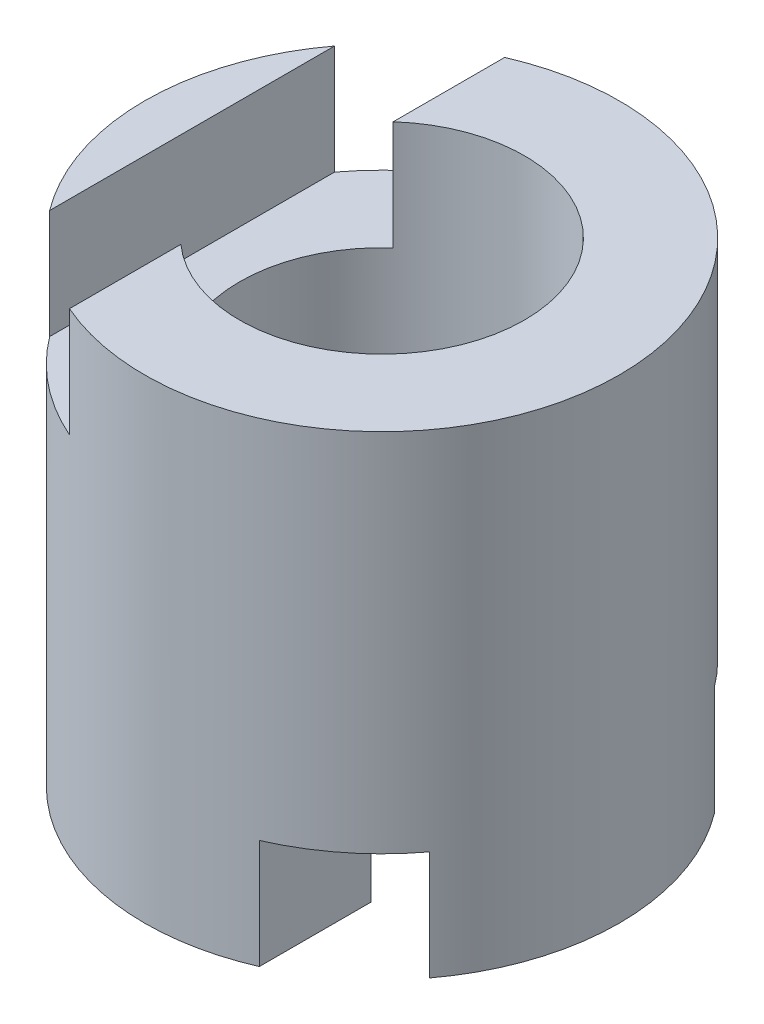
ISO-10303-21;
HEADER;
FILE_DESCRIPTION(('STEP AP214'),'2;1');
FILE_NAME('part.step','',(''),(''),'','','');
FILE_SCHEMA(('AUTOMOTIVE_DESIGN { 1 0 10303 214 1 1 1 1 }'));
ENDSEC;
DATA;
#1=APPLICATION_CONTEXT('core data for automotive mechanical design processes');
#2=APPLICATION_PROTOCOL_DEFINITION('international standard','automotive_design',2000,#1);
#3=PRODUCT_CONTEXT('',#1,'mechanical');
#4=PRODUCT('Part','Part','',(#3));
#5=PRODUCT_RELATED_PRODUCT_CATEGORY('part','',(#4));
#6=PRODUCT_DEFINITION_FORMATION('','',#4);
#7=PRODUCT_DEFINITION_CONTEXT('part definition',#1,'design');
#8=PRODUCT_DEFINITION('design','',#6,#7);
#9=PRODUCT_DEFINITION_SHAPE('','',#8);
#10=(LENGTH_UNIT() NAMED_UNIT(*) SI_UNIT(.MILLI.,.METRE.));
#11=(NAMED_UNIT(*) PLANE_ANGLE_UNIT() SI_UNIT($,.RADIAN.));
#12=(NAMED_UNIT(*) SI_UNIT($,.STERADIAN.) SOLID_ANGLE_UNIT());
#13=UNCERTAINTY_MEASURE_WITH_UNIT(LENGTH_MEASURE(1.E-05),#10,'distance_accuracy_value','');
#14=(GEOMETRIC_REPRESENTATION_CONTEXT(3) GLOBAL_UNCERTAINTY_ASSIGNED_CONTEXT((#13)) GLOBAL_UNIT_ASSIGNED_CONTEXT((#10,
#11,#12)) REPRESENTATION_CONTEXT('',''));
#15=CARTESIAN_POINT('',(0.,0.,0.));
#16=DIRECTION('',(0.,0.,1.));
#17=DIRECTION('',(1.,0.,0.));
#18=AXIS2_PLACEMENT_3D('',#15,#16,#17);
#19=CARTESIAN_POINT('',(0.,-100.,0.));
#20=DIRECTION('',(0.,1.,0.));
#21=DIRECTION('',(0.,0.,1.));
#22=AXIS2_PLACEMENT_3D('',#19,#20,#21);
#23=PLANE('',#22);
#24=CARTESIAN_POINT('',(0.,-100.,0.));
#25=DIRECTION('',(0.,1.,0.));
#26=DIRECTION('',(0.,0.,1.));
#27=AXIS2_PLACEMENT_3D('',#24,#25,#26);
#28=CIRCLE('',#27,50.);
#29=CARTESIAN_POINT('',(20.,-100.,-45.8257569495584));
#30=VERTEX_POINT('',#29);
#31=CARTESIAN_POINT('',(20.,-100.,45.8257569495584));
#32=VERTEX_POINT('',#31);
#33=EDGE_CURVE('E203',#30,#32,#28,.T.);
#34=ORIENTED_EDGE('',*,*,#33,.F.);
#35=DIRECTION('',(0.,0.,1.));
#36=VECTOR('',#35,1.);
#37=CARTESIAN_POINT('',(20.,-100.,-50.));
#38=LINE('',#37,#36);
#39=CARTESIAN_POINT('',(20.,-100.,-22.3606797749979));
#40=VERTEX_POINT('',#39);
#41=EDGE_CURVE('E143',#30,#40,#38,.T.);
#42=ORIENTED_EDGE('',*,*,#41,.T.);
#43=CARTESIAN_POINT('',(0.,-100.,0.));
#44=DIRECTION('',(0.,1.,0.));
#45=DIRECTION('',(0.,0.,1.));
#46=AXIS2_PLACEMENT_3D('',#43,#44,#45);
#47=CIRCLE('',#46,30.);
#48=CARTESIAN_POINT('',(20.,-100.,22.3606797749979));
#49=VERTEX_POINT('',#48);
#50=EDGE_CURVE('E195',#40,#49,#47,.T.);
#51=ORIENTED_EDGE('',*,*,#50,.T.);
#52=EDGE_CURVE('E169',#49,#32,#38,.T.);
#53=ORIENTED_EDGE('',*,*,#52,.T.);
#54=EDGE_LOOP('',(#34,#42,#51,#53));
#55=FACE_BOUND('',#54,.T.);
#56=ADVANCED_FACE('F47',(#55),#23,.F.);
#57=CARTESIAN_POINT('',(0.,0.,0.));
#58=DIRECTION('',(0.,1.,0.));
#59=DIRECTION('',(0.,0.,1.));
#60=AXIS2_PLACEMENT_3D('',#57,#58,#59);
#61=PLANE('',#60);
#62=DIRECTION('',(0.,0.,1.));
#63=VECTOR('',#62,1.);
#64=CARTESIAN_POINT('',(-20.,0.,-50.));
#65=LINE('',#64,#63);
#66=CARTESIAN_POINT('',(-20.,0.,22.3606797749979));
#67=VERTEX_POINT('',#66);
#68=CARTESIAN_POINT('',(-20.,0.,45.8257569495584));
#69=VERTEX_POINT('',#68);
#70=EDGE_CURVE('E234',#67,#69,#65,.T.);
#71=ORIENTED_EDGE('',*,*,#70,.T.);
#72=CARTESIAN_POINT('',(0.,0.,0.));
#73=DIRECTION('',(0.,1.,0.));
#74=DIRECTION('',(0.,0.,1.));
#75=AXIS2_PLACEMENT_3D('',#72,#73,#74);
#76=CIRCLE('',#75,50.);
#77=CARTESIAN_POINT('',(-20.,0.,-45.8257569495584));
#78=VERTEX_POINT('',#77);
#79=EDGE_CURVE('E199',#69,#78,#76,.T.);
#80=ORIENTED_EDGE('',*,*,#79,.T.);
#81=CARTESIAN_POINT('',(-20.,0.,-22.3606797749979));
#82=VERTEX_POINT('',#81);
#83=EDGE_CURVE('E167',#78,#82,#65,.T.);
#84=ORIENTED_EDGE('',*,*,#83,.T.);
#85=CARTESIAN_POINT('',(0.,0.,0.));
#86=DIRECTION('',(0.,1.,0.));
#87=DIRECTION('',(0.,0.,1.));
#88=AXIS2_PLACEMENT_3D('',#85,#86,#87);
#89=CIRCLE('',#88,30.);
#90=EDGE_CURVE('E194',#67,#82,#89,.T.);
#91=ORIENTED_EDGE('',*,*,#90,.F.);
#92=EDGE_LOOP('',(#71,#80,#84,#91));
#93=FACE_BOUND('',#92,.T.);
#94=ADVANCED_FACE('F233',(#93),#61,.T.);
#95=CARTESIAN_POINT('',(0.,-100.,0.));
#96=DIRECTION('',(0.,1.,0.));
#97=DIRECTION('',(0.,0.,1.));
#98=AXIS2_PLACEMENT_3D('',#95,#96,#97);
#99=CYLINDRICAL_SURFACE('',#98,50.);
#100=DIRECTION('',(0.,1.,0.));
#101=VECTOR('',#100,1.);
#102=CARTESIAN_POINT('',(-20.,-100.,45.8257569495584));
#103=LINE('',#102,#101);
#104=CARTESIAN_POINT('',(-20.,-23.,45.8257569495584));
#105=VERTEX_POINT('',#104);
#106=EDGE_CURVE('E177',#105,#69,#103,.T.);
#107=ORIENTED_EDGE('',*,*,#106,.F.);
#108=CARTESIAN_POINT('',(0.,-23.,0.));
#109=DIRECTION('',(0.,-1.,0.));
#110=DIRECTION('',(0.,0.,-1.));
#111=AXIS2_PLACEMENT_3D('',#108,#109,#110);
#112=CIRCLE('',#111,50.);
#113=CARTESIAN_POINT('',(-40.,-23.,30.));
#114=VERTEX_POINT('',#113);
#115=EDGE_CURVE('E173',#114,#105,#112,.F.);
#116=ORIENTED_EDGE('',*,*,#115,.F.);
#117=DIRECTION('',(0.,1.,0.));
#118=VECTOR('',#117,1.);
#119=CARTESIAN_POINT('',(-40.,-100.,30.));
#120=LINE('',#119,#118);
#121=CARTESIAN_POINT('',(-40.,0.,30.));
#122=VERTEX_POINT('',#121);
#123=EDGE_CURVE('E186',#122,#114,#120,.F.);
#124=ORIENTED_EDGE('',*,*,#123,.F.);
#125=CARTESIAN_POINT('',(-40.,0.,-30.));
#126=VERTEX_POINT('',#125);
#127=EDGE_CURVE('E207',#126,#122,#76,.T.);
#128=ORIENTED_EDGE('',*,*,#127,.F.);
#129=DIRECTION('',(0.,1.,0.));
#130=VECTOR('',#129,1.);
#131=CARTESIAN_POINT('',(-40.,-100.,-30.));
#132=LINE('',#131,#130);
#133=CARTESIAN_POINT('',(-40.,-23.,-30.));
#134=VERTEX_POINT('',#133);
#135=EDGE_CURVE('E183',#134,#126,#132,.T.);
#136=ORIENTED_EDGE('',*,*,#135,.F.);
#137=CARTESIAN_POINT('',(-20.,-23.,-45.8257569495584));
#138=VERTEX_POINT('',#137);
#139=EDGE_CURVE('E176',#138,#134,#112,.F.);
#140=ORIENTED_EDGE('',*,*,#139,.F.);
#141=DIRECTION('',(0.,1.,0.));
#142=VECTOR('',#141,1.);
#143=CARTESIAN_POINT('',(-20.,-100.,-45.8257569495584));
#144=LINE('',#143,#142);
#145=EDGE_CURVE('E180',#78,#138,#144,.F.);
#146=ORIENTED_EDGE('',*,*,#145,.F.);
#147=ORIENTED_EDGE('',*,*,#79,.F.);
#148=EDGE_LOOP('',(#107,#116,#124,#128,#136,#140,#146,#147));
#149=FACE_BOUND('',#148,.T.);
#150=DIRECTION('',(0.,1.,0.));
#151=VECTOR('',#150,1.);
#152=CARTESIAN_POINT('',(20.,-100.,-45.8257569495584));
#153=LINE('',#152,#151);
#154=CARTESIAN_POINT('',(20.,-77.,-45.8257569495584));
#155=VERTEX_POINT('',#154);
#156=EDGE_CURVE('E137',#30,#155,#153,.T.);
#157=ORIENTED_EDGE('',*,*,#156,.F.);
#158=ORIENTED_EDGE('',*,*,#33,.T.);
#159=DIRECTION('',(0.,1.,0.));
#160=VECTOR('',#159,1.);
#161=CARTESIAN_POINT('',(20.,-100.,45.8257569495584));
#162=LINE('',#161,#160);
#163=CARTESIAN_POINT('',(20.,-77.,45.8257569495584));
#164=VERTEX_POINT('',#163);
#165=EDGE_CURVE('E149',#164,#32,#162,.F.);
#166=ORIENTED_EDGE('',*,*,#165,.F.);
#167=CARTESIAN_POINT('',(0.,-77.,0.));
#168=DIRECTION('',(0.,1.,0.));
#169=DIRECTION('',(0.,0.,1.));
#170=AXIS2_PLACEMENT_3D('',#167,#168,#169);
#171=CIRCLE('',#170,50.);
#172=CARTESIAN_POINT('',(40.,-77.,30.));
#173=VERTEX_POINT('',#172);
#174=EDGE_CURVE('E164',#173,#164,#171,.F.);
#175=ORIENTED_EDGE('',*,*,#174,.F.);
#176=DIRECTION('',(0.,1.,0.));
#177=VECTOR('',#176,1.);
#178=CARTESIAN_POINT('',(40.,-100.,30.));
#179=LINE('',#178,#177);
#180=CARTESIAN_POINT('',(40.,-100.,30.));
#181=VERTEX_POINT('',#180);
#182=EDGE_CURVE('E189',#181,#173,#179,.T.);
#183=ORIENTED_EDGE('',*,*,#182,.F.);
#184=CARTESIAN_POINT('',(40.,-100.,-30.));
#185=VERTEX_POINT('',#184);
#186=EDGE_CURVE('E206',#181,#185,#28,.T.);
#187=ORIENTED_EDGE('',*,*,#186,.T.);
#188=DIRECTION('',(0.,1.,0.));
#189=VECTOR('',#188,1.);
#190=CARTESIAN_POINT('',(40.,-100.,-30.));
#191=LINE('',#190,#189);
#192=CARTESIAN_POINT('',(40.,-77.,-30.));
#193=VERTEX_POINT('',#192);
#194=EDGE_CURVE('E162',#193,#185,#191,.F.);
#195=ORIENTED_EDGE('',*,*,#194,.F.);
#196=EDGE_CURVE('E150',#155,#193,#171,.F.);
#197=ORIENTED_EDGE('',*,*,#196,.F.);
#198=EDGE_LOOP('',(#157,#158,#166,#175,#183,#187,#195,#197));
#199=FACE_BOUND('',#198,.T.);
#200=ADVANCED_FACE('F49',(#149,#199),#99,.T.);
#201=ORIENTED_EDGE('',*,*,#186,.F.);
#202=DIRECTION('',(0.,0.,1.));
#203=VECTOR('',#202,1.);
#204=CARTESIAN_POINT('',(40.,-100.,-50.));
#205=LINE('',#204,#203);
#206=EDGE_CURVE('E252',#185,#181,#205,.T.);
#207=ORIENTED_EDGE('',*,*,#206,.F.);
#208=EDGE_LOOP('',(#201,#207));
#209=FACE_BOUND('',#208,.T.);
#210=ADVANCED_FACE('F278',(#209),#23,.F.);
#211=DIRECTION('',(0.,0.,1.));
#212=VECTOR('',#211,1.);
#213=CARTESIAN_POINT('',(-40.,0.,-50.));
#214=LINE('',#213,#212);
#215=EDGE_CURVE('E249',#126,#122,#214,.T.);
#216=ORIENTED_EDGE('',*,*,#215,.F.);
#217=ORIENTED_EDGE('',*,*,#127,.T.);
#218=EDGE_LOOP('',(#216,#217));
#219=FACE_BOUND('',#218,.T.);
#220=ADVANCED_FACE('F273',(#219),#61,.T.);
#221=CARTESIAN_POINT('',(0.,-100.,0.));
#222=DIRECTION('',(0.,1.,0.));
#223=DIRECTION('',(0.,0.,1.));
#224=AXIS2_PLACEMENT_3D('',#221,#222,#223);
#225=CYLINDRICAL_SURFACE('',#224,30.);
#226=ORIENTED_EDGE('',*,*,#90,.T.);
#227=DIRECTION('',(0.,1.,0.));
#228=VECTOR('',#227,1.);
#229=CARTESIAN_POINT('',(-20.,-100.,-22.3606797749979));
#230=LINE('',#229,#228);
#231=CARTESIAN_POINT('',(-20.,-23.,-22.3606797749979));
#232=VERTEX_POINT('',#231);
#233=EDGE_CURVE('E12',#82,#232,#230,.F.);
#234=ORIENTED_EDGE('',*,*,#233,.T.);
#235=CARTESIAN_POINT('',(0.,-23.,0.));
#236=DIRECTION('',(0.,-1.,0.));
#237=DIRECTION('',(0.,0.,-1.));
#238=AXIS2_PLACEMENT_3D('',#235,#236,#237);
#239=CIRCLE('',#238,30.);
#240=CARTESIAN_POINT('',(-20.,-23.,22.3606797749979));
#241=VERTEX_POINT('',#240);
#242=EDGE_CURVE('E220',#232,#241,#239,.F.);
#243=ORIENTED_EDGE('',*,*,#242,.T.);
#244=DIRECTION('',(0.,1.,0.));
#245=VECTOR('',#244,1.);
#246=CARTESIAN_POINT('',(-20.,-100.,22.3606797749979));
#247=LINE('',#246,#245);
#248=EDGE_CURVE('E56',#241,#67,#247,.T.);
#249=ORIENTED_EDGE('',*,*,#248,.T.);
#250=EDGE_LOOP('',(#226,#234,#243,#249));
#251=FACE_BOUND('',#250,.T.);
#252=CARTESIAN_POINT('',(0.,-77.,0.));
#253=DIRECTION('',(0.,1.,0.));
#254=DIRECTION('',(0.,0.,1.));
#255=AXIS2_PLACEMENT_3D('',#252,#253,#254);
#256=CIRCLE('',#255,30.);
#257=CARTESIAN_POINT('',(20.,-77.,-22.3606797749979));
#258=VERTEX_POINT('',#257);
#259=CARTESIAN_POINT('',(20.,-77.,22.3606797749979));
#260=VERTEX_POINT('',#259);
#261=EDGE_CURVE('E156',#258,#260,#256,.F.);
#262=ORIENTED_EDGE('',*,*,#261,.T.);
#263=DIRECTION('',(0.,1.,0.));
#264=VECTOR('',#263,1.);
#265=CARTESIAN_POINT('',(20.,-100.,22.3606797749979));
#266=LINE('',#265,#264);
#267=EDGE_CURVE('E216',#260,#49,#266,.F.);
#268=ORIENTED_EDGE('',*,*,#267,.T.);
#269=ORIENTED_EDGE('',*,*,#50,.F.);
#270=DIRECTION('',(0.,1.,0.));
#271=VECTOR('',#270,1.);
#272=CARTESIAN_POINT('',(20.,-100.,-22.3606797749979));
#273=LINE('',#272,#271);
#274=EDGE_CURVE('E213',#40,#258,#273,.T.);
#275=ORIENTED_EDGE('',*,*,#274,.T.);
#276=EDGE_LOOP('',(#262,#268,#269,#275));
#277=FACE_BOUND('',#276,.T.);
#278=ADVANCED_FACE('F227',(#251,#277),#225,.F.);
#279=CARTESIAN_POINT('',(20.,-77.,-50.));
#280=DIRECTION('',(-1.,0.,0.));
#281=DIRECTION('',(0.,-1.,0.));
#282=AXIS2_PLACEMENT_3D('',#279,#280,#281);
#283=PLANE('',#282);
#284=ORIENTED_EDGE('',*,*,#165,.T.);
#285=ORIENTED_EDGE('',*,*,#52,.F.);
#286=ORIENTED_EDGE('',*,*,#267,.F.);
#287=DIRECTION('',(0.,0.,1.));
#288=VECTOR('',#287,1.);
#289=CARTESIAN_POINT('',(20.,-77.,-50.));
#290=LINE('',#289,#288);
#291=EDGE_CURVE('E71',#260,#164,#290,.T.);
#292=ORIENTED_EDGE('',*,*,#291,.T.);
#293=EDGE_LOOP('',(#284,#285,#286,#292));
#294=FACE_BOUND('',#293,.T.);
#295=ADVANCED_FACE('F266',(#294),#283,.F.);
#296=ORIENTED_EDGE('',*,*,#156,.T.);
#297=EDGE_CURVE('E140',#155,#258,#290,.T.);
#298=ORIENTED_EDGE('',*,*,#297,.T.);
#299=ORIENTED_EDGE('',*,*,#274,.F.);
#300=ORIENTED_EDGE('',*,*,#41,.F.);
#301=EDGE_LOOP('',(#296,#298,#299,#300));
#302=FACE_BOUND('',#301,.T.);
#303=ADVANCED_FACE('F139',(#302),#283,.F.);
#304=CARTESIAN_POINT('',(40.,-77.,-50.));
#305=DIRECTION('',(0.,1.,0.));
#306=DIRECTION('',(0.,0.,1.));
#307=AXIS2_PLACEMENT_3D('',#304,#305,#306);
#308=PLANE('',#307);
#309=ORIENTED_EDGE('',*,*,#196,.T.);
#310=DIRECTION('',(0.,0.,1.));
#311=VECTOR('',#310,1.);
#312=CARTESIAN_POINT('',(40.,-77.,-50.));
#313=LINE('',#312,#311);
#314=EDGE_CURVE('E158',#193,#173,#313,.T.);
#315=ORIENTED_EDGE('',*,*,#314,.T.);
#316=ORIENTED_EDGE('',*,*,#174,.T.);
#317=ORIENTED_EDGE('',*,*,#291,.F.);
#318=ORIENTED_EDGE('',*,*,#261,.F.);
#319=ORIENTED_EDGE('',*,*,#297,.F.);
#320=EDGE_LOOP('',(#309,#315,#316,#317,#318,#319));
#321=FACE_BOUND('',#320,.T.);
#322=ADVANCED_FACE('F152',(#321),#308,.F.);
#323=CARTESIAN_POINT('',(40.,-100.,-50.));
#324=DIRECTION('',(1.,0.,0.));
#325=DIRECTION('',(0.,0.,-1.));
#326=AXIS2_PLACEMENT_3D('',#323,#324,#325);
#327=PLANE('',#326);
#328=ORIENTED_EDGE('',*,*,#194,.T.);
#329=ORIENTED_EDGE('',*,*,#206,.T.);
#330=ORIENTED_EDGE('',*,*,#182,.T.);
#331=ORIENTED_EDGE('',*,*,#314,.F.);
#332=EDGE_LOOP('',(#328,#329,#330,#331));
#333=FACE_BOUND('',#332,.T.);
#334=ADVANCED_FACE('F318',(#333),#327,.F.);
#335=CARTESIAN_POINT('',(-20.,-23.,-50.));
#336=DIRECTION('',(1.,0.,0.));
#337=DIRECTION('',(0.,1.,0.));
#338=AXIS2_PLACEMENT_3D('',#335,#336,#337);
#339=PLANE('',#338);
#340=ORIENTED_EDGE('',*,*,#145,.T.);
#341=DIRECTION('',(0.,0.,1.));
#342=VECTOR('',#341,1.);
#343=CARTESIAN_POINT('',(-20.,-23.,-50.));
#344=LINE('',#343,#342);
#345=EDGE_CURVE('E241',#138,#232,#344,.T.);
#346=ORIENTED_EDGE('',*,*,#345,.T.);
#347=ORIENTED_EDGE('',*,*,#233,.F.);
#348=ORIENTED_EDGE('',*,*,#83,.F.);
#349=EDGE_LOOP('',(#340,#346,#347,#348));
#350=FACE_BOUND('',#349,.T.);
#351=ADVANCED_FACE('F311',(#350),#339,.F.);
#352=ORIENTED_EDGE('',*,*,#106,.T.);
#353=ORIENTED_EDGE('',*,*,#70,.F.);
#354=ORIENTED_EDGE('',*,*,#248,.F.);
#355=EDGE_CURVE('E63',#241,#105,#344,.T.);
#356=ORIENTED_EDGE('',*,*,#355,.T.);
#357=EDGE_LOOP('',(#352,#353,#354,#356));
#358=FACE_BOUND('',#357,.T.);
#359=ADVANCED_FACE('F309',(#358),#339,.F.);
#360=CARTESIAN_POINT('',(-40.,-23.,-50.));
#361=DIRECTION('',(0.,-1.,0.));
#362=DIRECTION('',(0.,0.,-1.));
#363=AXIS2_PLACEMENT_3D('',#360,#361,#362);
#364=PLANE('',#363);
#365=ORIENTED_EDGE('',*,*,#139,.T.);
#366=DIRECTION('',(0.,0.,1.));
#367=VECTOR('',#366,1.);
#368=CARTESIAN_POINT('',(-40.,-23.,-50.));
#369=LINE('',#368,#367);
#370=EDGE_CURVE('E245',#134,#114,#369,.T.);
#371=ORIENTED_EDGE('',*,*,#370,.T.);
#372=ORIENTED_EDGE('',*,*,#115,.T.);
#373=ORIENTED_EDGE('',*,*,#355,.F.);
#374=ORIENTED_EDGE('',*,*,#242,.F.);
#375=ORIENTED_EDGE('',*,*,#345,.F.);
#376=EDGE_LOOP('',(#365,#371,#372,#373,#374,#375));
#377=FACE_BOUND('',#376,.T.);
#378=ADVANCED_FACE('F299',(#377),#364,.F.);
#379=CARTESIAN_POINT('',(-40.,0.,-50.));
#380=DIRECTION('',(-1.,0.,0.));
#381=DIRECTION('',(0.,-1.,0.));
#382=AXIS2_PLACEMENT_3D('',#379,#380,#381);
#383=PLANE('',#382);
#384=ORIENTED_EDGE('',*,*,#123,.T.);
#385=ORIENTED_EDGE('',*,*,#370,.F.);
#386=ORIENTED_EDGE('',*,*,#135,.T.);
#387=ORIENTED_EDGE('',*,*,#215,.T.);
#388=EDGE_LOOP('',(#384,#385,#386,#387));
#389=FACE_BOUND('',#388,.T.);
#390=ADVANCED_FACE('F304',(#389),#383,.F.);
#391=CLOSED_SHELL('',(#56,#94,#200,#210,#220,#278,#295,#303,#322,#334,#351,#359,#378,#390));
#392=MANIFOLD_SOLID_BREP('B2',#391);
#393=ADVANCED_BREP_SHAPE_REPRESENTATION('',(#18,#392),#14);
#394=SHAPE_DEFINITION_REPRESENTATION(#9,#393);
ENDSEC;
END-ISO-10303-21;
